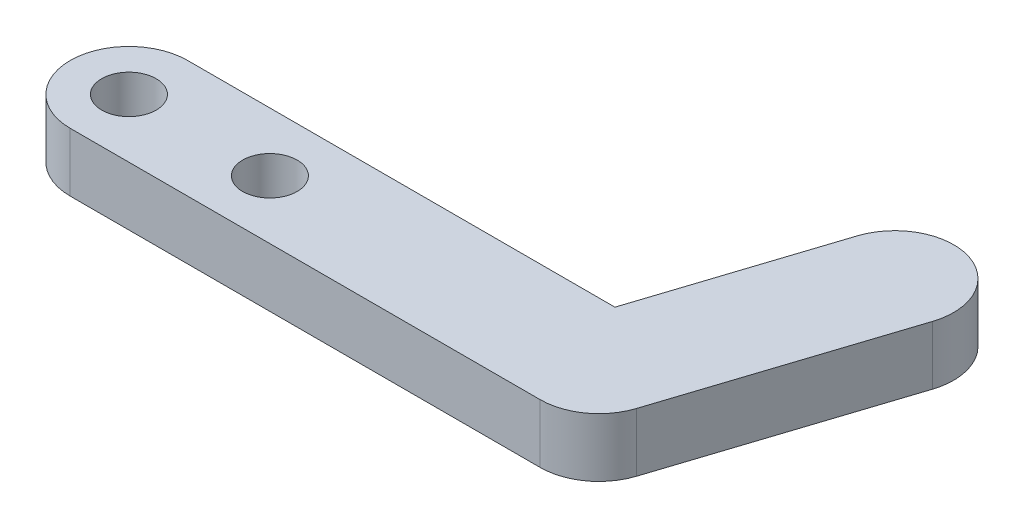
from build123d import *

# Parameters (mm, degrees)
BOSS_EXTRUDE1_DEPTH   = 3.175
BOSS_EXTRUDE2_DEPTH   = 3.175
F_4_CLEARANCE_HOLE1_D = 2.9464


with BuildPart() as part:
    # Sketch1 → Boss-Extrude1 (new body)
    with BuildSketch(Plane(origin=(0, 0, 0), x_dir=(1, 0, 0), z_dir=(0, 1, 0))):
        with BuildLine():
            Line((0, 3.175), (25.4, 3.175))
            ThreePointArc((25.4, 3.175), (28.575, 0), (25.4, -3.175))
            Line((25.4, -3.175), (0, -3.175))
            ThreePointArc((0, -3.175), (-3.175, 0), (0, 3.175))
        make_face()
    extrude(amount=BOSS_EXTRUDE1_DEPTH)

    # Sketch2 → Boss-Extrude2 (add)
    with BuildSketch(Plane(origin=(0, 0, 0), x_dir=(1, 0, 0), z_dir=(0, 1, 0))):
        with BuildLine():
            Line((22.380395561, 0.981128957), (26.304911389, 13.059546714))
            ThreePointArc((26.304911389, 13.059546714), (30.305644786, 15.098022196), (32.344120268, 11.0972888))
            Line((32.344120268, 11.0972888), (28.419604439, -0.981128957))
            ThreePointArc((28.419604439, -0.981128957), (24.418871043, -3.019604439), (22.380395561, 0.981128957))
        make_face()
    extrude(amount=BOSS_EXTRUDE2_DEPTH)

    # 4 Clearance Hole1 (through all)
    with Locations(Plane(origin=(0, 3.175, 0), x_dir=(1, 0, 0), z_dir=(0, 1, 0))):
        with Locations((0, 0), (7.62, 0)):
            Hole(F_4_CLEARANCE_HOLE1_D / 2)


solid = part.part
